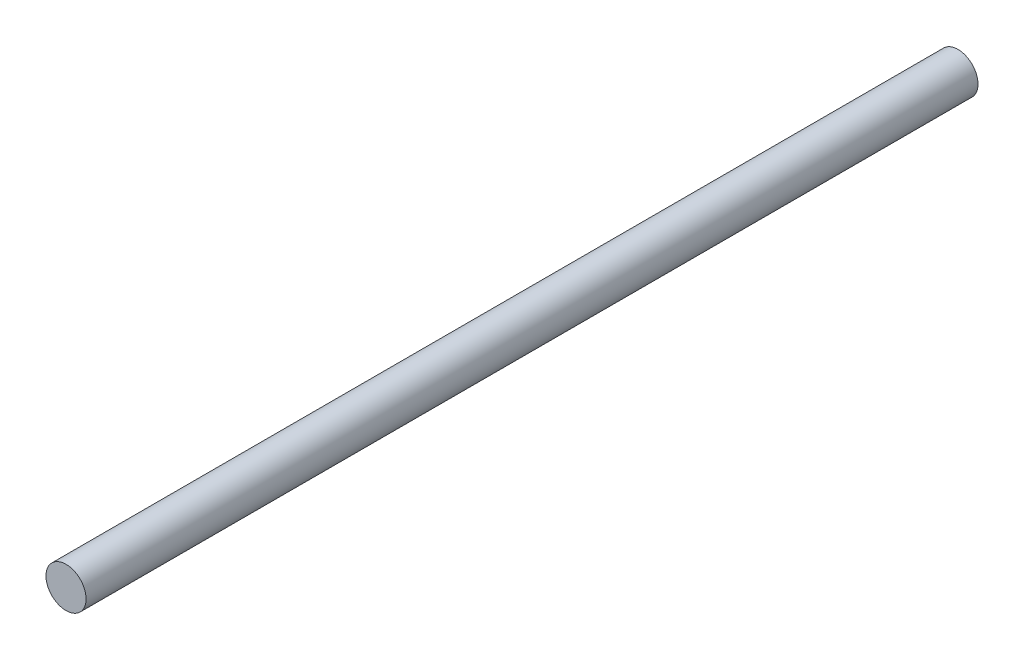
ISO-10303-21;
HEADER;
FILE_DESCRIPTION(('STEP AP214'),'2;1');
FILE_NAME('part.step','',(''),(''),'','','');
FILE_SCHEMA(('AUTOMOTIVE_DESIGN { 1 0 10303 214 1 1 1 1 }'));
ENDSEC;
DATA;
#1=APPLICATION_CONTEXT('core data for automotive mechanical design processes');
#2=APPLICATION_PROTOCOL_DEFINITION('international standard','automotive_design',2000,#1);
#3=PRODUCT_CONTEXT('',#1,'mechanical');
#4=PRODUCT('Part','Part','',(#3));
#5=PRODUCT_RELATED_PRODUCT_CATEGORY('part','',(#4));
#6=PRODUCT_DEFINITION_FORMATION('','',#4);
#7=PRODUCT_DEFINITION_CONTEXT('part definition',#1,'design');
#8=PRODUCT_DEFINITION('design','',#6,#7);
#9=PRODUCT_DEFINITION_SHAPE('','',#8);
#10=(LENGTH_UNIT() NAMED_UNIT(*) SI_UNIT(.MILLI.,.METRE.));
#11=(NAMED_UNIT(*) PLANE_ANGLE_UNIT() SI_UNIT($,.RADIAN.));
#12=(NAMED_UNIT(*) SI_UNIT($,.STERADIAN.) SOLID_ANGLE_UNIT());
#13=UNCERTAINTY_MEASURE_WITH_UNIT(LENGTH_MEASURE(1.E-05),#10,'distance_accuracy_value','');
#14=(GEOMETRIC_REPRESENTATION_CONTEXT(3) GLOBAL_UNCERTAINTY_ASSIGNED_CONTEXT((#13)) GLOBAL_UNIT_ASSIGNED_CONTEXT((#10,
#11,#12)) REPRESENTATION_CONTEXT('',''));
#15=CARTESIAN_POINT('',(0.,0.,0.));
#16=DIRECTION('',(0.,0.,1.));
#17=DIRECTION('',(1.,0.,0.));
#18=AXIS2_PLACEMENT_3D('',#15,#16,#17);
#19=CARTESIAN_POINT('',(0.,0.,134.45));
#20=DIRECTION('',(0.,0.,-1.));
#21=DIRECTION('',(-1.,0.,0.));
#22=AXIS2_PLACEMENT_3D('',#19,#20,#21);
#23=CYLINDRICAL_SURFACE('',#22,3.025);
#24=CARTESIAN_POINT('',(0.,0.,134.45));
#25=DIRECTION('',(0.,0.,1.));
#26=DIRECTION('',(1.,0.,0.));
#27=AXIS2_PLACEMENT_3D('',#24,#25,#26);
#28=CIRCLE('',#27,3.025);
#29=CARTESIAN_POINT('',(3.025,0.,134.45));
#30=VERTEX_POINT('',#29);
#31=EDGE_CURVE('E10',#30,#30,#28,.T.);
#32=ORIENTED_EDGE('',*,*,#31,.F.);
#33=EDGE_LOOP('',(#32));
#34=FACE_BOUND('',#33,.T.);
#35=CARTESIAN_POINT('',(0.,0.,0.));
#36=DIRECTION('',(0.,0.,1.));
#37=DIRECTION('',(1.,0.,0.));
#38=AXIS2_PLACEMENT_3D('',#35,#36,#37);
#39=CIRCLE('',#38,3.025);
#40=CARTESIAN_POINT('',(3.025,0.,0.));
#41=VERTEX_POINT('',#40);
#42=EDGE_CURVE('E40',#41,#41,#39,.T.);
#43=ORIENTED_EDGE('',*,*,#42,.T.);
#44=EDGE_LOOP('',(#43));
#45=FACE_BOUND('',#44,.T.);
#46=ADVANCED_FACE('F37',(#34,#45),#23,.T.);
#47=CARTESIAN_POINT('',(0.,0.,134.45));
#48=DIRECTION('',(0.,0.,1.));
#49=DIRECTION('',(1.,0.,0.));
#50=AXIS2_PLACEMENT_3D('',#47,#48,#49);
#51=PLANE('',#50);
#52=ORIENTED_EDGE('',*,*,#31,.T.);
#53=EDGE_LOOP('',(#52));
#54=FACE_BOUND('',#53,.T.);
#55=ADVANCED_FACE('F52',(#54),#51,.T.);
#56=CARTESIAN_POINT('',(0.,0.,0.));
#57=DIRECTION('',(0.,0.,1.));
#58=DIRECTION('',(1.,0.,0.));
#59=AXIS2_PLACEMENT_3D('',#56,#57,#58);
#60=PLANE('',#59);
#61=ORIENTED_EDGE('',*,*,#42,.F.);
#62=EDGE_LOOP('',(#61));
#63=FACE_BOUND('',#62,.T.);
#64=ADVANCED_FACE('F50',(#63),#60,.F.);
#65=CLOSED_SHELL('',(#46,#55,#64));
#66=MANIFOLD_SOLID_BREP('B2',#65);
#67=ADVANCED_BREP_SHAPE_REPRESENTATION('',(#18,#66),#14);
#68=SHAPE_DEFINITION_REPRESENTATION(#9,#67);
ENDSEC;
END-ISO-10303-21;
